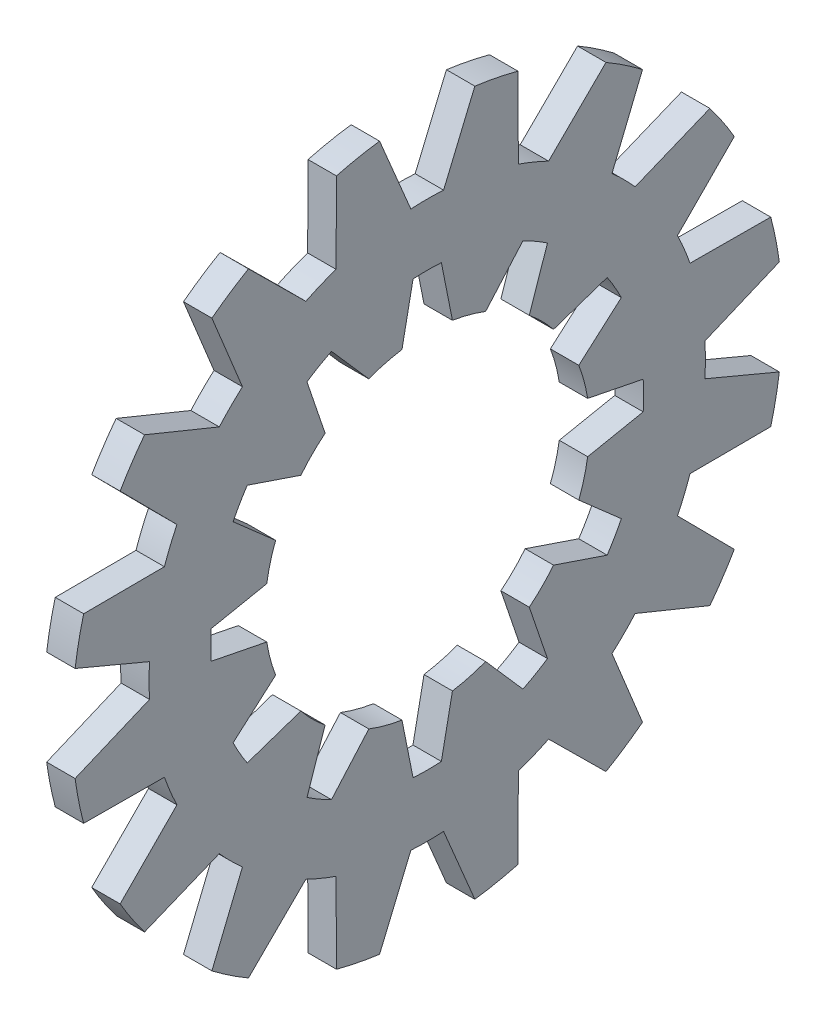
from build123d import *

# Parameters (mm, degrees)
SECSKE_W      = 1.4
SECSKE_H      = 9.5
EXTCUT_DEPTH  = 25.788303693
EXTCUTS_COUNT = 16
EXTCUTS_ANGLE = 337.5
INTCUT_DEPTH  = 25.565286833
INTCUTS_COUNT = 12
INTCUTS_ANGLE = 330


with BuildPart() as part:
    # SecSke → Body (revolve)
    with BuildSketch(Plane.XY, mode=Mode.PRIVATE) as body_sk:
        with Locations((-0.7, 12.75)):
            Rectangle(SECSKE_W, SECSKE_H)
    revolve(body_sk.sketch.rotate(Axis((-34.925, 0, 0), (1, 0, 0)), 90), axis=Axis((-34.925, 0, 0), (1, 0, 0)))

    # ExtCutSke → ExtCut (cut, through all)
    with BuildSketch(Plane(origin=(0, 0, 0), x_dir=(0, 0, -1), z_dir=(1, 0, 0))):
        with BuildLine():
            Line((-2.696172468, 18.176118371), (-0.80653001, 13.67623886))
            ThreePointArc((-0.80653001, 13.67623886), (0, 13.7), (0.80653001, 13.67623886))
            Line((0.80653001, 13.67623886), (2.696172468, 18.176118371))
            ThreePointArc((2.696172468, 18.176118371), (0, 18.375), (-2.696172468, 18.176118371))
        make_face()
    extcut = extrude(amount=-EXTCUT_DEPTH, mode=Mode.SUBTRACT)

    # ExtCuts: ExtCut ×16 about axis
    extcuts_axis = Axis((-34.925, 0, 0), (1, 0, 0))
    for i in range(1, EXTCUTS_COUNT):
        add(extcut.rotate(extcuts_axis, i * EXTCUTS_ANGLE / (EXTCUTS_COUNT - 1)), mode=Mode.SUBTRACT)

    # IntCutSke → IntCut (cut, through all)
    with BuildSketch(Plane(origin=(0, 0, 0), x_dir=(0, 0, -1), z_dir=(1, 0, 0))):
        with BuildLine():
            Line((-0.697197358, 10.637176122), (-1.326257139, 7.483384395))
            ThreePointArc((-1.326257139, 7.483384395), (0, 7.6), (1.326257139, 7.483384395))
            Line((1.326257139, 7.483384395), (0.697197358, 10.637176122))
            ThreePointArc((0.697197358, 10.637176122), (0, 10.66), (-0.697197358, 10.637176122))
        make_face()
    intcut = extrude(amount=-INTCUT_DEPTH, mode=Mode.SUBTRACT)

    # IntCuts: IntCut ×12 about axis
    intcuts_axis = Axis((-34.925, 0, 0), (1, 0, 0))
    for i in range(1, INTCUTS_COUNT):
        add(intcut.rotate(intcuts_axis, i * INTCUTS_ANGLE / (INTCUTS_COUNT - 1)), mode=Mode.SUBTRACT)


solid = part.part
